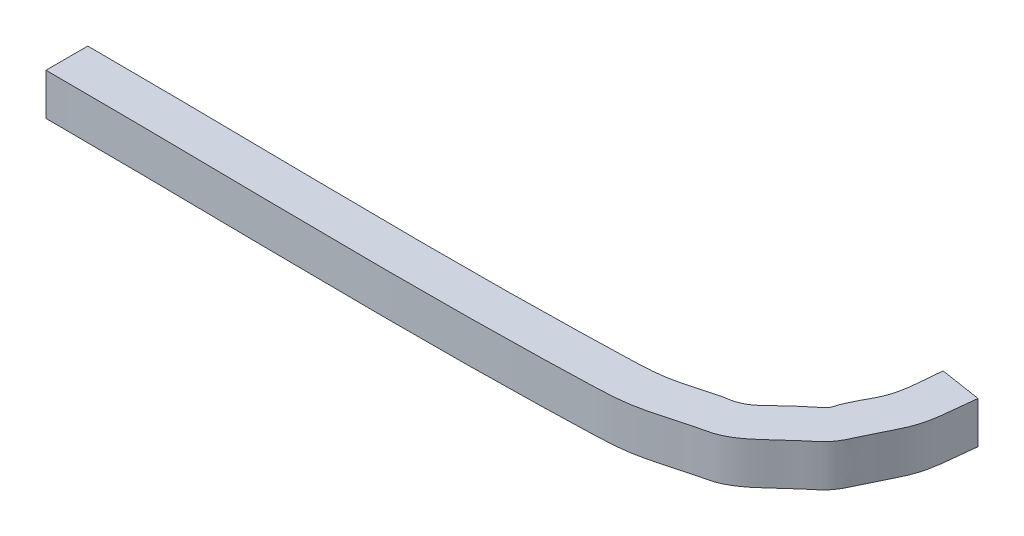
ISO-10303-21;
HEADER;
FILE_DESCRIPTION(('STEP AP214'),'2;1');
FILE_NAME('part.step','',(''),(''),'','','');
FILE_SCHEMA(('AUTOMOTIVE_DESIGN { 1 0 10303 214 1 1 1 1 }'));
ENDSEC;
DATA;
#1=APPLICATION_CONTEXT('core data for automotive mechanical design processes');
#2=APPLICATION_PROTOCOL_DEFINITION('international standard','automotive_design',2000,#1);
#3=PRODUCT_CONTEXT('',#1,'mechanical');
#4=PRODUCT('Part','Part','',(#3));
#5=PRODUCT_RELATED_PRODUCT_CATEGORY('part','',(#4));
#6=PRODUCT_DEFINITION_FORMATION('','',#4);
#7=PRODUCT_DEFINITION_CONTEXT('part definition',#1,'design');
#8=PRODUCT_DEFINITION('design','',#6,#7);
#9=PRODUCT_DEFINITION_SHAPE('','',#8);
#10=(LENGTH_UNIT() NAMED_UNIT(*) SI_UNIT(.MILLI.,.METRE.));
#11=(NAMED_UNIT(*) PLANE_ANGLE_UNIT() SI_UNIT($,.RADIAN.));
#12=(NAMED_UNIT(*) SI_UNIT($,.STERADIAN.) SOLID_ANGLE_UNIT());
#13=UNCERTAINTY_MEASURE_WITH_UNIT(LENGTH_MEASURE(1.E-05),#10,'distance_accuracy_value','');
#14=(GEOMETRIC_REPRESENTATION_CONTEXT(3) GLOBAL_UNCERTAINTY_ASSIGNED_CONTEXT((#13)) GLOBAL_UNIT_ASSIGNED_CONTEXT((#10,
#11,#12)) REPRESENTATION_CONTEXT('',''));
#15=CARTESIAN_POINT('',(0.,0.,0.));
#16=DIRECTION('',(0.,0.,1.));
#17=DIRECTION('',(1.,0.,0.));
#18=AXIS2_PLACEMENT_3D('',#15,#16,#17);
#19=CARTESIAN_POINT('',(89.7416427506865,5.,-26.7336931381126));
#20=DIRECTION('',(-0.154543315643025,0.,0.987986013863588));
#21=DIRECTION('',(0.987986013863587,0.,0.154543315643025));
#22=AXIS2_PLACEMENT_3D('',#19,#20,#21);
#23=PLANE('',#22);
#24=DIRECTION('',(0.,-1.,0.));
#25=VECTOR('',#24,1.);
#26=CARTESIAN_POINT('',(89.7416427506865,0.,-26.7336931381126));
#27=LINE('',#26,#25);
#28=CARTESIAN_POINT('',(89.7416427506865,5.,-26.7336931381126));
#29=VERTEX_POINT('',#28);
#30=CARTESIAN_POINT('',(89.7416427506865,0.,-26.7336931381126));
#31=VERTEX_POINT('',#30);
#32=EDGE_CURVE('E90',#29,#31,#27,.T.);
#33=ORIENTED_EDGE('',*,*,#32,.T.);
#34=DIRECTION('',(-0.987986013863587,0.,-0.154543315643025));
#35=VECTOR('',#34,1.);
#36=CARTESIAN_POINT('',(89.7416427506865,0.,-26.7336931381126));
#37=LINE('',#36,#35);
#38=CARTESIAN_POINT('',(84.8017126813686,0.,-27.5064097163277));
#39=VERTEX_POINT('',#38);
#40=EDGE_CURVE('E97',#31,#39,#37,.T.);
#41=ORIENTED_EDGE('',*,*,#40,.T.);
#42=DIRECTION('',(0.,1.,0.));
#43=VECTOR('',#42,1.);
#44=CARTESIAN_POINT('',(84.8017126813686,0.,-27.5064097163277));
#45=LINE('',#44,#43);
#46=CARTESIAN_POINT('',(84.8017126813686,5.,-27.5064097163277));
#47=VERTEX_POINT('',#46);
#48=EDGE_CURVE('E91',#39,#47,#45,.T.);
#49=ORIENTED_EDGE('',*,*,#48,.T.);
#50=DIRECTION('',(0.987986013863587,0.,0.154543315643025));
#51=VECTOR('',#50,1.);
#52=CARTESIAN_POINT('',(89.7416427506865,5.,-26.7336931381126));
#53=LINE('',#52,#51);
#54=EDGE_CURVE('E51',#47,#29,#53,.T.);
#55=ORIENTED_EDGE('',*,*,#54,.T.);
#56=EDGE_LOOP('',(#33,#41,#49,#55));
#57=FACE_BOUND('',#56,.T.);
#58=ADVANCED_FACE('F47',(#57),#23,.F.);
#59=CARTESIAN_POINT('',(0.,5.,-5.));
#60=DIRECTION('',(-1.,0.,0.));
#61=DIRECTION('',(0.,0.,1.));
#62=AXIS2_PLACEMENT_3D('',#59,#60,#61);
#63=PLANE('',#62);
#64=DIRECTION('',(0.,-1.,0.));
#65=VECTOR('',#64,1.);
#66=CARTESIAN_POINT('',(0.,0.,-5.));
#67=LINE('',#66,#65);
#68=CARTESIAN_POINT('',(0.,5.,-5.));
#69=VERTEX_POINT('',#68);
#70=CARTESIAN_POINT('',(0.,0.,-5.));
#71=VERTEX_POINT('',#70);
#72=EDGE_CURVE('E101',#69,#71,#67,.T.);
#73=ORIENTED_EDGE('',*,*,#72,.F.);
#74=DIRECTION('',(0.,0.,1.));
#75=VECTOR('',#74,1.);
#76=CARTESIAN_POINT('',(0.,5.,-5.));
#77=LINE('',#76,#75);
#78=CARTESIAN_POINT('',(0.,5.,-10.));
#79=VERTEX_POINT('',#78);
#80=EDGE_CURVE('E12',#79,#69,#77,.T.);
#81=ORIENTED_EDGE('',*,*,#80,.F.);
#82=DIRECTION('',(0.,1.,0.));
#83=VECTOR('',#82,1.);
#84=CARTESIAN_POINT('',(0.,0.,-10.));
#85=LINE('',#84,#83);
#86=CARTESIAN_POINT('',(0.,0.,-10.));
#87=VERTEX_POINT('',#86);
#88=EDGE_CURVE('E57',#87,#79,#85,.T.);
#89=ORIENTED_EDGE('',*,*,#88,.F.);
#90=DIRECTION('',(0.,0.,-1.));
#91=VECTOR('',#90,1.);
#92=CARTESIAN_POINT('',(0.,0.,-5.));
#93=LINE('',#92,#91);
#94=EDGE_CURVE('E103',#71,#87,#93,.T.);
#95=ORIENTED_EDGE('',*,*,#94,.F.);
#96=EDGE_LOOP('',(#73,#81,#89,#95));
#97=FACE_BOUND('',#96,.T.);
#98=ADVANCED_FACE('F140',(#97),#63,.T.);
#99=CARTESIAN_POINT('',(0.,5.,-10.));
#100=DIRECTION('',(0.,1.,0.));
#101=DIRECTION('',(0.,0.,1.));
#102=AXIS2_PLACEMENT_3D('',#99,#100,#101);
#103=PLANE('',#102);
#104=ORIENTED_EDGE('',*,*,#80,.T.);
#105=CARTESIAN_POINT('',(0.,5.,-5.));
#106=CARTESIAN_POINT('',(18.0622917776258,5.,-4.99456538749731));
#107=CARTESIAN_POINT('',(38.6859325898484,5.,-4.36511498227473));
#108=CARTESIAN_POINT('',(60.7210490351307,5.,-4.84149894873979));
#109=CARTESIAN_POINT('',(65.4974421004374,5.,-4.99048761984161));
#110=CARTESIAN_POINT('',(67.8258508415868,5.,-5.07509635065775));
#111=CARTESIAN_POINT('',(70.8673538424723,5.,-5.49307683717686));
#112=CARTESIAN_POINT('',(73.2724925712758,5.,-6.1902484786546));
#113=CARTESIAN_POINT('',(75.9638397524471,5.,-6.92569912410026));
#114=CARTESIAN_POINT('',(77.5161969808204,5.,-7.22974918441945));
#115=CARTESIAN_POINT('',(78.3985445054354,5.,-7.63680964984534));
#116=CARTESIAN_POINT('',(79.776139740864,5.,-8.40447583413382));
#117=CARTESIAN_POINT('',(81.0560932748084,5.,-9.49731956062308));
#118=CARTESIAN_POINT('',(83.287862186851,5.,-11.6106787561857));
#119=CARTESIAN_POINT('',(84.4027565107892,5.,-12.4709540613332));
#120=CARTESIAN_POINT('',(85.0683220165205,5.,-13.0881044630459));
#121=CARTESIAN_POINT('',(85.794668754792,5.,-13.9248831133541));
#122=CARTESIAN_POINT('',(86.4646871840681,5.,-15.2801859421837));
#123=CARTESIAN_POINT('',(87.4872843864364,5.,-17.5421326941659));
#124=CARTESIAN_POINT('',(88.4664701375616,5.,-19.3828460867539));
#125=CARTESIAN_POINT('',(89.452445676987,5.,-22.3487363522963));
#126=CARTESIAN_POINT('',(89.4470002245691,5.,-24.6902817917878));
#127=CARTESIAN_POINT('',(89.7416427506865,5.,-26.7336931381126));
#128=B_SPLINE_CURVE_WITH_KNOTS('',3,(#105,#106,#107,#108,#109,#110,#111,#112,#113,#114,#115,
#116,#117,#118,#119,#120,#121,#122,#123,#124,#125,#126,#127),.UNSPECIFIED.,.F.,.F.,(4,1,1,1,1,1,
1,1,1,1,1,1,1,1,1,1,1,1,1,1,4),(0.,0.500000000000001,0.57,0.601922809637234,0.639639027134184,
0.64,0.695,0.71518399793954,0.732567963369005,0.749999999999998,0.750285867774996,
0.791666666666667,0.817218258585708,0.832363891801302,0.833333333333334,0.847726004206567,0.875,
0.905413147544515,0.931733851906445,0.9375,1.),.UNSPECIFIED.);
#129=EDGE_CURVE('E66',#69,#29,#128,.T.);
#130=ORIENTED_EDGE('',*,*,#129,.T.);
#131=ORIENTED_EDGE('',*,*,#54,.F.);
#132=CARTESIAN_POINT('',(0.,5.,-10.));
#133=CARTESIAN_POINT('',(17.9791900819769,5.,-9.98913077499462));
#134=CARTESIAN_POINT('',(38.5080949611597,5.,-9.35348491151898));
#135=CARTESIAN_POINT('',(60.6838250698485,5.,-9.84495103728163));
#136=CARTESIAN_POINT('',(65.1568247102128,5.,-9.97861524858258));
#137=CARTESIAN_POINT('',(67.2670268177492,5.,-10.044143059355));
#138=CARTESIAN_POINT('',(70.0123805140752,5.,-10.4242112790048));
#139=CARTESIAN_POINT('',(72.1705414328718,5.,-11.0757649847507));
#140=CARTESIAN_POINT('',(74.2958276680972,5.,-11.6524691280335));
#141=CARTESIAN_POINT('',(75.4517051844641,5.,-11.8033418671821));
#142=CARTESIAN_POINT('',(76.0546362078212,5.,-12.0634028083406));
#143=CARTESIAN_POINT('',(76.947100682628,5.,-12.5289913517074));
#144=CARTESIAN_POINT('',(77.6388179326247,5.,-13.1356128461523));
#145=CARTESIAN_POINT('',(79.8911085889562,5.,-15.3288733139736));
#146=CARTESIAN_POINT('',(80.9396490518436,5.,-16.1000312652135));
#147=CARTESIAN_POINT('',(81.481989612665,5.,-16.5563158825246));
#148=CARTESIAN_POINT('',(81.9322149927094,5.,-17.0359454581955));
#149=CARTESIAN_POINT('',(81.9347273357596,5.,-17.4987512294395));
#150=CARTESIAN_POINT('',(82.6987062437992,5.,-19.2272577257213));
#151=CARTESIAN_POINT('',(83.6632585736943,5.,-20.8591731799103));
#152=CARTESIAN_POINT('',(84.6294490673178,5.,-23.5347012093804));
#153=CARTESIAN_POINT('',(84.5629587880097,5.,-25.6605113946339));
#154=CARTESIAN_POINT('',(84.8017126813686,5.,-27.5064097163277));
#155=B_SPLINE_CURVE_WITH_KNOTS('',3,(#132,#133,#134,#135,#136,#137,#138,#139,#140,#141,#142,
#143,#144,#145,#146,#147,#148,#149,#150,#151,#152,#153,#154),.UNSPECIFIED.,.F.,.F.,(4,1,1,1,1,1,
1,1,1,1,1,1,1,1,1,1,1,1,1,1,4),(0.,0.500000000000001,0.57,0.601922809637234,0.639639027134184,
0.64,0.695,0.71518399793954,0.732567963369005,0.749999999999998,0.750285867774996,
0.791666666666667,0.817218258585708,0.832363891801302,0.833333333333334,0.847726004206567,0.875,
0.905413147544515,0.931733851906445,0.9375,1.),.UNSPECIFIED.);
#156=EDGE_CURVE('E83',#79,#47,#155,.T.);
#157=ORIENTED_EDGE('',*,*,#156,.F.);
#158=EDGE_LOOP('',(#104,#130,#131,#157));
#159=FACE_BOUND('',#158,.T.);
#160=ADVANCED_FACE('F99',(#159),#103,.T.);
#161=CARTESIAN_POINT('',(0.,0.,-10.));
#162=CARTESIAN_POINT('',(17.9791900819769,0.,-9.98913077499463));
#163=CARTESIAN_POINT('',(38.5080949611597,0.,-9.35348491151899));
#164=CARTESIAN_POINT('',(60.6838250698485,0.,-9.84495103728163));
#165=CARTESIAN_POINT('',(65.1568247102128,0.,-9.97861524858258));
#166=CARTESIAN_POINT('',(67.2670268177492,0.,-10.0441430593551));
#167=CARTESIAN_POINT('',(70.0123805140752,0.,-10.4242112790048));
#168=CARTESIAN_POINT('',(72.1705414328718,0.,-11.0757649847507));
#169=CARTESIAN_POINT('',(74.2958276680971,0.,-11.6524691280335));
#170=CARTESIAN_POINT('',(75.451705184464,0.,-11.8033418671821));
#171=CARTESIAN_POINT('',(76.0546362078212,0.,-12.0634028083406));
#172=CARTESIAN_POINT('',(76.947100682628,0.,-12.5289913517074));
#173=CARTESIAN_POINT('',(77.6388179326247,0.,-13.1356128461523));
#174=CARTESIAN_POINT('',(79.8911085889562,0.,-15.3288733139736));
#175=CARTESIAN_POINT('',(80.9396490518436,0.,-16.1000312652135));
#176=CARTESIAN_POINT('',(81.481989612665,0.,-16.5563158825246));
#177=CARTESIAN_POINT('',(81.9322149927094,0.,-17.0359454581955));
#178=CARTESIAN_POINT('',(81.9347273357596,0.,-17.4987512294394));
#179=CARTESIAN_POINT('',(82.6987062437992,0.,-19.2272577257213));
#180=CARTESIAN_POINT('',(83.6632585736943,0.,-20.8591731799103));
#181=CARTESIAN_POINT('',(84.6294490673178,0.,-23.5347012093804));
#182=CARTESIAN_POINT('',(84.5629587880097,0.,-25.6605113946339));
#183=CARTESIAN_POINT('',(84.8017126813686,0.,-27.5064097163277));
#184=CARTESIAN_POINT('',(0.,5.,-10.));
#185=CARTESIAN_POINT('',(17.9791900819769,5.,-9.98913077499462));
#186=CARTESIAN_POINT('',(38.5080949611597,5.,-9.35348491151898));
#187=CARTESIAN_POINT('',(60.6838250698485,5.,-9.84495103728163));
#188=CARTESIAN_POINT('',(65.1568247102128,5.,-9.97861524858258));
#189=CARTESIAN_POINT('',(67.2670268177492,5.,-10.044143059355));
#190=CARTESIAN_POINT('',(70.0123805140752,5.,-10.4242112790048));
#191=CARTESIAN_POINT('',(72.1705414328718,5.,-11.0757649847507));
#192=CARTESIAN_POINT('',(74.2958276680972,5.,-11.6524691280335));
#193=CARTESIAN_POINT('',(75.4517051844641,5.,-11.8033418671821));
#194=CARTESIAN_POINT('',(76.0546362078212,5.,-12.0634028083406));
#195=CARTESIAN_POINT('',(76.947100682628,5.,-12.5289913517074));
#196=CARTESIAN_POINT('',(77.6388179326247,5.,-13.1356128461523));
#197=CARTESIAN_POINT('',(79.8911085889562,5.,-15.3288733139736));
#198=CARTESIAN_POINT('',(80.9396490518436,5.,-16.1000312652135));
#199=CARTESIAN_POINT('',(81.481989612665,5.,-16.5563158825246));
#200=CARTESIAN_POINT('',(81.9322149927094,5.,-17.0359454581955));
#201=CARTESIAN_POINT('',(81.9347273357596,5.,-17.4987512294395));
#202=CARTESIAN_POINT('',(82.6987062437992,5.,-19.2272577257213));
#203=CARTESIAN_POINT('',(83.6632585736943,5.,-20.8591731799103));
#204=CARTESIAN_POINT('',(84.6294490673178,5.,-23.5347012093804));
#205=CARTESIAN_POINT('',(84.5629587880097,5.,-25.6605113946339));
#206=CARTESIAN_POINT('',(84.8017126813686,5.,-27.5064097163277));
#207=B_SPLINE_SURFACE_WITH_KNOTS('',1,3,((#161,#162,#163,#164,#165,#166,#167,#168,#169,#170,
#171,#172,#173,#174,#175,#176,#177,#178,#179,#180,#181,#182,#183),(#184,#185,#186,#187,#188,
#189,#190,#191,#192,#193,#194,#195,#196,#197,#198,#199,#200,#201,#202,#203,#204,#205,#206)),
.UNSPECIFIED.,.F.,.F.,.F.,(2,2),(4,1,1,1,1,1,1,1,1,1,1,1,1,1,1,1,1,1,1,1,4),(0.5,0.75),(0.,
0.500000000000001,0.57,0.601922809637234,0.639639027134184,0.64,0.695,0.71518399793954,
0.732567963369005,0.749999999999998,0.750285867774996,0.791666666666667,0.817218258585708,
0.832363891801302,0.833333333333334,0.847726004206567,0.875,0.905413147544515,0.931733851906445,
0.9375,1.),.UNSPECIFIED.);
#208=CARTESIAN_POINT('',(0.,0.,-10.));
#209=CARTESIAN_POINT('',(17.9791900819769,0.,-9.98913077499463));
#210=CARTESIAN_POINT('',(38.5080949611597,0.,-9.35348491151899));
#211=CARTESIAN_POINT('',(60.6838250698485,0.,-9.84495103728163));
#212=CARTESIAN_POINT('',(65.1568247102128,0.,-9.97861524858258));
#213=CARTESIAN_POINT('',(67.2670268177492,0.,-10.0441430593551));
#214=CARTESIAN_POINT('',(70.0123805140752,0.,-10.4242112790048));
#215=CARTESIAN_POINT('',(72.1705414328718,0.,-11.0757649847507));
#216=CARTESIAN_POINT('',(74.2958276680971,0.,-11.6524691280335));
#217=CARTESIAN_POINT('',(75.451705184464,0.,-11.8033418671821));
#218=CARTESIAN_POINT('',(76.0546362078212,0.,-12.0634028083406));
#219=CARTESIAN_POINT('',(76.947100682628,0.,-12.5289913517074));
#220=CARTESIAN_POINT('',(77.6388179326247,0.,-13.1356128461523));
#221=CARTESIAN_POINT('',(79.8911085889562,0.,-15.3288733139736));
#222=CARTESIAN_POINT('',(80.9396490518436,0.,-16.1000312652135));
#223=CARTESIAN_POINT('',(81.481989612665,0.,-16.5563158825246));
#224=CARTESIAN_POINT('',(81.9322149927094,0.,-17.0359454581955));
#225=CARTESIAN_POINT('',(81.9347273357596,0.,-17.4987512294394));
#226=CARTESIAN_POINT('',(82.6987062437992,0.,-19.2272577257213));
#227=CARTESIAN_POINT('',(83.6632585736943,0.,-20.8591731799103));
#228=CARTESIAN_POINT('',(84.6294490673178,0.,-23.5347012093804));
#229=CARTESIAN_POINT('',(84.5629587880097,0.,-25.6605113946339));
#230=CARTESIAN_POINT('',(84.8017126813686,0.,-27.5064097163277));
#231=B_SPLINE_CURVE_WITH_KNOTS('',3,(#208,#209,#210,#211,#212,#213,#214,#215,#216,#217,#218,
#219,#220,#221,#222,#223,#224,#225,#226,#227,#228,#229,#230),.UNSPECIFIED.,.F.,.F.,(4,1,1,1,1,1,
1,1,1,1,1,1,1,1,1,1,1,1,1,1,4),(0.,0.500000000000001,0.57,0.601922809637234,0.639639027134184,
0.64,0.695,0.71518399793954,0.732567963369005,0.749999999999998,0.750285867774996,
0.791666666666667,0.817218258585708,0.832363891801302,0.833333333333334,0.847726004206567,0.875,
0.905413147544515,0.931733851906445,0.9375,1.),.UNSPECIFIED.);
#232=EDGE_CURVE('E105',#87,#39,#231,.T.);
#233=ORIENTED_EDGE('',*,*,#88,.T.);
#234=ORIENTED_EDGE('',*,*,#156,.T.);
#235=ORIENTED_EDGE('',*,*,#48,.F.);
#236=ORIENTED_EDGE('',*,*,#232,.F.);
#237=EDGE_LOOP('',(#233,#234,#235,#236));
#238=FACE_BOUND('',#237,.T.);
#239=ADVANCED_FACE('F136',(#238),#207,.T.);
#240=CARTESIAN_POINT('',(0.,0.,-5.));
#241=DIRECTION('',(0.,-1.,0.));
#242=DIRECTION('',(0.,0.,-1.));
#243=AXIS2_PLACEMENT_3D('',#240,#241,#242);
#244=PLANE('',#243);
#245=ORIENTED_EDGE('',*,*,#94,.T.);
#246=ORIENTED_EDGE('',*,*,#232,.T.);
#247=ORIENTED_EDGE('',*,*,#40,.F.);
#248=CARTESIAN_POINT('',(0.,0.,-5.));
#249=CARTESIAN_POINT('',(18.0622917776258,0.,-4.99456538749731));
#250=CARTESIAN_POINT('',(38.6859325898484,0.,-4.36511498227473));
#251=CARTESIAN_POINT('',(60.7210490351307,0.,-4.84149894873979));
#252=CARTESIAN_POINT('',(65.4974421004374,0.,-4.99048761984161));
#253=CARTESIAN_POINT('',(67.8258508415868,0.,-5.07509635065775));
#254=CARTESIAN_POINT('',(70.8673538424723,0.,-5.49307683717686));
#255=CARTESIAN_POINT('',(73.2724925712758,0.,-6.1902484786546));
#256=CARTESIAN_POINT('',(75.9638397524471,0.,-6.92569912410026));
#257=CARTESIAN_POINT('',(77.5161969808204,0.,-7.22974918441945));
#258=CARTESIAN_POINT('',(78.3985445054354,0.,-7.63680964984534));
#259=CARTESIAN_POINT('',(79.776139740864,0.,-8.40447583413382));
#260=CARTESIAN_POINT('',(81.0560932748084,0.,-9.49731956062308));
#261=CARTESIAN_POINT('',(83.287862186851,0.,-11.6106787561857));
#262=CARTESIAN_POINT('',(84.4027565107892,0.,-12.4709540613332));
#263=CARTESIAN_POINT('',(85.0683220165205,0.,-13.0881044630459));
#264=CARTESIAN_POINT('',(85.794668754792,0.,-13.9248831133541));
#265=CARTESIAN_POINT('',(86.4646871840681,0.,-15.2801859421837));
#266=CARTESIAN_POINT('',(87.4872843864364,0.,-17.5421326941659));
#267=CARTESIAN_POINT('',(88.4664701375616,0.,-19.3828460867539));
#268=CARTESIAN_POINT('',(89.452445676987,0.,-22.3487363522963));
#269=CARTESIAN_POINT('',(89.4470002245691,0.,-24.6902817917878));
#270=CARTESIAN_POINT('',(89.7416427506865,0.,-26.7336931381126));
#271=B_SPLINE_CURVE_WITH_KNOTS('',3,(#248,#249,#250,#251,#252,#253,#254,#255,#256,#257,#258,
#259,#260,#261,#262,#263,#264,#265,#266,#267,#268,#269,#270),.UNSPECIFIED.,.F.,.F.,(4,1,1,1,1,1,
1,1,1,1,1,1,1,1,1,1,1,1,1,1,4),(0.,0.500000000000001,0.57,0.601922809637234,0.639639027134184,
0.64,0.695,0.71518399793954,0.732567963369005,0.749999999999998,0.750285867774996,
0.791666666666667,0.817218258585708,0.832363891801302,0.833333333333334,0.847726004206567,0.875,
0.905413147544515,0.931733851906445,0.9375,1.),.UNSPECIFIED.);
#272=EDGE_CURVE('E93',#71,#31,#271,.T.);
#273=ORIENTED_EDGE('',*,*,#272,.F.);
#274=EDGE_LOOP('',(#245,#246,#247,#273));
#275=FACE_BOUND('',#274,.T.);
#276=ADVANCED_FACE('F49',(#275),#244,.T.);
#277=CARTESIAN_POINT('',(0.,5.,-5.));
#278=CARTESIAN_POINT('',(18.0622917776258,5.,-4.99456538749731));
#279=CARTESIAN_POINT('',(38.6859325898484,5.,-4.36511498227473));
#280=CARTESIAN_POINT('',(60.7210490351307,5.,-4.84149894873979));
#281=CARTESIAN_POINT('',(65.4974421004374,5.,-4.99048761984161));
#282=CARTESIAN_POINT('',(67.8258508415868,5.,-5.07509635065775));
#283=CARTESIAN_POINT('',(70.8673538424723,5.,-5.49307683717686));
#284=CARTESIAN_POINT('',(73.2724925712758,5.,-6.1902484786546));
#285=CARTESIAN_POINT('',(75.9638397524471,5.,-6.92569912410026));
#286=CARTESIAN_POINT('',(77.5161969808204,5.,-7.22974918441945));
#287=CARTESIAN_POINT('',(78.3985445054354,5.,-7.63680964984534));
#288=CARTESIAN_POINT('',(79.776139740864,5.,-8.40447583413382));
#289=CARTESIAN_POINT('',(81.0560932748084,5.,-9.49731956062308));
#290=CARTESIAN_POINT('',(83.287862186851,5.,-11.6106787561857));
#291=CARTESIAN_POINT('',(84.4027565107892,5.,-12.4709540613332));
#292=CARTESIAN_POINT('',(85.0683220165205,5.,-13.0881044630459));
#293=CARTESIAN_POINT('',(85.794668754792,5.,-13.9248831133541));
#294=CARTESIAN_POINT('',(86.4646871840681,5.,-15.2801859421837));
#295=CARTESIAN_POINT('',(87.4872843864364,5.,-17.5421326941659));
#296=CARTESIAN_POINT('',(88.4664701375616,5.,-19.3828460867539));
#297=CARTESIAN_POINT('',(89.452445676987,5.,-22.3487363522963));
#298=CARTESIAN_POINT('',(89.4470002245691,5.,-24.6902817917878));
#299=CARTESIAN_POINT('',(89.7416427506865,5.,-26.7336931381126));
#300=CARTESIAN_POINT('',(0.,0.,-5.));
#301=CARTESIAN_POINT('',(18.0622917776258,0.,-4.99456538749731));
#302=CARTESIAN_POINT('',(38.6859325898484,0.,-4.36511498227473));
#303=CARTESIAN_POINT('',(60.7210490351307,0.,-4.84149894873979));
#304=CARTESIAN_POINT('',(65.4974421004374,0.,-4.99048761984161));
#305=CARTESIAN_POINT('',(67.8258508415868,0.,-5.07509635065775));
#306=CARTESIAN_POINT('',(70.8673538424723,0.,-5.49307683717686));
#307=CARTESIAN_POINT('',(73.2724925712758,0.,-6.1902484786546));
#308=CARTESIAN_POINT('',(75.9638397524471,0.,-6.92569912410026));
#309=CARTESIAN_POINT('',(77.5161969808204,0.,-7.22974918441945));
#310=CARTESIAN_POINT('',(78.3985445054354,0.,-7.63680964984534));
#311=CARTESIAN_POINT('',(79.776139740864,0.,-8.40447583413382));
#312=CARTESIAN_POINT('',(81.0560932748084,0.,-9.49731956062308));
#313=CARTESIAN_POINT('',(83.287862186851,0.,-11.6106787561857));
#314=CARTESIAN_POINT('',(84.4027565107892,0.,-12.4709540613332));
#315=CARTESIAN_POINT('',(85.0683220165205,0.,-13.0881044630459));
#316=CARTESIAN_POINT('',(85.794668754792,0.,-13.9248831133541));
#317=CARTESIAN_POINT('',(86.4646871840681,0.,-15.2801859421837));
#318=CARTESIAN_POINT('',(87.4872843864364,0.,-17.5421326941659));
#319=CARTESIAN_POINT('',(88.4664701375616,0.,-19.3828460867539));
#320=CARTESIAN_POINT('',(89.452445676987,0.,-22.3487363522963));
#321=CARTESIAN_POINT('',(89.4470002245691,0.,-24.6902817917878));
#322=CARTESIAN_POINT('',(89.7416427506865,0.,-26.7336931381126));
#323=B_SPLINE_SURFACE_WITH_KNOTS('',1,3,((#277,#278,#279,#280,#281,#282,#283,#284,#285,#286,
#287,#288,#289,#290,#291,#292,#293,#294,#295,#296,#297,#298,#299),(#300,#301,#302,#303,#304,
#305,#306,#307,#308,#309,#310,#311,#312,#313,#314,#315,#316,#317,#318,#319,#320,#321,#322)),
.UNSPECIFIED.,.F.,.F.,.F.,(2,2),(4,1,1,1,1,1,1,1,1,1,1,1,1,1,1,1,1,1,1,1,4),(0.,0.25),(0.,
0.500000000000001,0.57,0.601922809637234,0.639639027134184,0.64,0.695,0.71518399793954,
0.732567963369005,0.749999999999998,0.750285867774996,0.791666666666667,0.817218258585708,
0.832363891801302,0.833333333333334,0.847726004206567,0.875,0.905413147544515,0.931733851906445,
0.9375,1.),.UNSPECIFIED.);
#324=ORIENTED_EDGE('',*,*,#72,.T.);
#325=ORIENTED_EDGE('',*,*,#272,.T.);
#326=ORIENTED_EDGE('',*,*,#32,.F.);
#327=ORIENTED_EDGE('',*,*,#129,.F.);
#328=EDGE_LOOP('',(#324,#325,#326,#327));
#329=FACE_BOUND('',#328,.T.);
#330=ADVANCED_FACE('F95',(#329),#323,.T.);
#331=CLOSED_SHELL('',(#58,#98,#160,#239,#276,#330));
#332=MANIFOLD_SOLID_BREP('B2',#331);
#333=ADVANCED_BREP_SHAPE_REPRESENTATION('',(#18,#332),#14);
#334=SHAPE_DEFINITION_REPRESENTATION(#9,#333);
ENDSEC;
END-ISO-10303-21;
